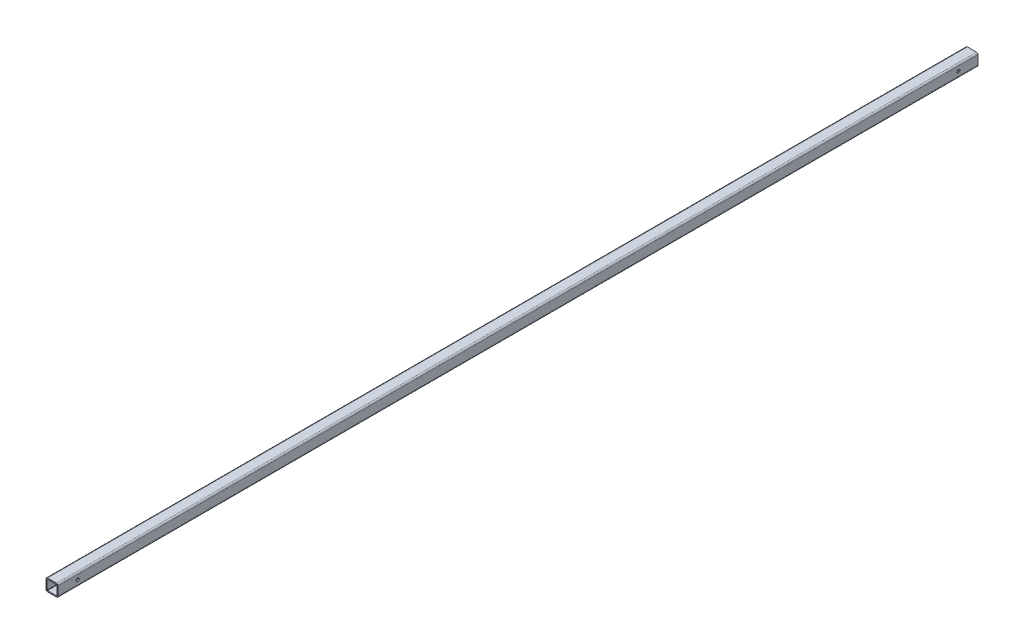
ISO-10303-21;
HEADER;
FILE_DESCRIPTION(('STEP AP214'),'2;1');
FILE_NAME('part.step','',(''),(''),'','','');
FILE_SCHEMA(('AUTOMOTIVE_DESIGN { 1 0 10303 214 1 1 1 1 }'));
ENDSEC;
DATA;
#1=APPLICATION_CONTEXT('core data for automotive mechanical design processes');
#2=APPLICATION_PROTOCOL_DEFINITION('international standard','automotive_design',2000,#1);
#3=PRODUCT_CONTEXT('',#1,'mechanical');
#4=PRODUCT('Part','Part','',(#3));
#5=PRODUCT_RELATED_PRODUCT_CATEGORY('part','',(#4));
#6=PRODUCT_DEFINITION_FORMATION('','',#4);
#7=PRODUCT_DEFINITION_CONTEXT('part definition',#1,'design');
#8=PRODUCT_DEFINITION('design','',#6,#7);
#9=PRODUCT_DEFINITION_SHAPE('','',#8);
#10=(LENGTH_UNIT() NAMED_UNIT(*) SI_UNIT(.MILLI.,.METRE.));
#11=(NAMED_UNIT(*) PLANE_ANGLE_UNIT() SI_UNIT($,.RADIAN.));
#12=(NAMED_UNIT(*) SI_UNIT($,.STERADIAN.) SOLID_ANGLE_UNIT());
#13=UNCERTAINTY_MEASURE_WITH_UNIT(LENGTH_MEASURE(1.E-05),#10,'distance_accuracy_value','');
#14=(GEOMETRIC_REPRESENTATION_CONTEXT(3) GLOBAL_UNCERTAINTY_ASSIGNED_CONTEXT((#13)) GLOBAL_UNIT_ASSIGNED_CONTEXT((#10,
#11,#12)) REPRESENTATION_CONTEXT('',''));
#15=CARTESIAN_POINT('',(0.,0.,0.));
#16=DIRECTION('',(0.,0.,1.));
#17=DIRECTION('',(1.,0.,0.));
#18=AXIS2_PLACEMENT_3D('',#15,#16,#17);
#19=CARTESIAN_POINT('',(6.,-6.,1220.));
#20=DIRECTION('',(0.,0.,1.));
#21=DIRECTION('',(1.,0.,0.));
#22=AXIS2_PLACEMENT_3D('',#19,#20,#21);
#23=PLANE('',#22);
#24=CARTESIAN_POINT('',(6.,-6.,1220.));
#25=DIRECTION('',(0.,0.,1.));
#26=DIRECTION('',(1.,0.,0.));
#27=AXIS2_PLACEMENT_3D('',#24,#25,#26);
#28=CIRCLE('',#27,2.);
#29=CARTESIAN_POINT('',(5.99999999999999,-8.,1220.));
#30=VERTEX_POINT('',#29);
#31=CARTESIAN_POINT('',(8.,-5.99999999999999,1220.));
#32=VERTEX_POINT('',#31);
#33=EDGE_CURVE('E215',#30,#32,#28,.T.);
#34=ORIENTED_EDGE('',*,*,#33,.T.);
#35=DIRECTION('',(0.,1.,0.));
#36=VECTOR('',#35,1.);
#37=CARTESIAN_POINT('',(8.,5.99999999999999,1220.));
#38=LINE('',#37,#36);
#39=CARTESIAN_POINT('',(8.,5.99999999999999,1220.));
#40=VERTEX_POINT('',#39);
#41=EDGE_CURVE('E218',#32,#40,#38,.T.);
#42=ORIENTED_EDGE('',*,*,#41,.T.);
#43=CARTESIAN_POINT('',(6.,6.,1220.));
#44=DIRECTION('',(0.,0.,1.));
#45=DIRECTION('',(-1.,0.,0.));
#46=AXIS2_PLACEMENT_3D('',#43,#44,#45);
#47=CIRCLE('',#46,2.);
#48=CARTESIAN_POINT('',(5.99999999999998,8.,1220.));
#49=VERTEX_POINT('',#48);
#50=EDGE_CURVE('E221',#40,#49,#47,.T.);
#51=ORIENTED_EDGE('',*,*,#50,.T.);
#52=DIRECTION('',(-1.,0.,0.));
#53=VECTOR('',#52,1.);
#54=CARTESIAN_POINT('',(-5.99999999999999,8.,1220.));
#55=LINE('',#54,#53);
#56=CARTESIAN_POINT('',(-5.99999999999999,8.,1220.));
#57=VERTEX_POINT('',#56);
#58=EDGE_CURVE('E223',#49,#57,#55,.T.);
#59=ORIENTED_EDGE('',*,*,#58,.T.);
#60=CARTESIAN_POINT('',(-6.,6.,1220.));
#61=DIRECTION('',(0.,0.,1.));
#62=DIRECTION('',(1.,0.,0.));
#63=AXIS2_PLACEMENT_3D('',#60,#61,#62);
#64=CIRCLE('',#63,2.);
#65=CARTESIAN_POINT('',(-8.,5.99999999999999,1220.));
#66=VERTEX_POINT('',#65);
#67=EDGE_CURVE('E225',#57,#66,#64,.T.);
#68=ORIENTED_EDGE('',*,*,#67,.T.);
#69=DIRECTION('',(0.,-1.,0.));
#70=VECTOR('',#69,1.);
#71=CARTESIAN_POINT('',(-8.,5.99999999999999,1220.));
#72=LINE('',#71,#70);
#73=CARTESIAN_POINT('',(-8.,-5.99999999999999,1220.));
#74=VERTEX_POINT('',#73);
#75=EDGE_CURVE('E227',#66,#74,#72,.T.);
#76=ORIENTED_EDGE('',*,*,#75,.T.);
#77=CARTESIAN_POINT('',(-6.,-6.,1220.));
#78=DIRECTION('',(0.,0.,1.));
#79=DIRECTION('',(1.,0.,0.));
#80=AXIS2_PLACEMENT_3D('',#77,#78,#79);
#81=CIRCLE('',#80,2.);
#82=CARTESIAN_POINT('',(-5.99999999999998,-8.,1220.));
#83=VERTEX_POINT('',#82);
#84=EDGE_CURVE('E229',#74,#83,#81,.T.);
#85=ORIENTED_EDGE('',*,*,#84,.T.);
#86=DIRECTION('',(1.,0.,0.));
#87=VECTOR('',#86,1.);
#88=CARTESIAN_POINT('',(-5.99999999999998,-8.,1220.));
#89=LINE('',#88,#87);
#90=EDGE_CURVE('E231',#83,#30,#89,.T.);
#91=ORIENTED_EDGE('',*,*,#90,.T.);
#92=EDGE_LOOP('',(#34,#42,#51,#59,#68,#76,#85,#91));
#93=FACE_BOUND('',#92,.T.);
#94=DIRECTION('',(0.,-1.,0.));
#95=VECTOR('',#94,1.);
#96=CARTESIAN_POINT('',(-6.5,5.99999999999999,1220.));
#97=LINE('',#96,#95);
#98=CARTESIAN_POINT('',(-6.5,5.99999999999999,1220.));
#99=VERTEX_POINT('',#98);
#100=CARTESIAN_POINT('',(-6.5,-5.99999999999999,1220.));
#101=VERTEX_POINT('',#100);
#102=EDGE_CURVE('E156',#99,#101,#97,.T.);
#103=ORIENTED_EDGE('',*,*,#102,.F.);
#104=CARTESIAN_POINT('',(-6.,6.,1220.));
#105=DIRECTION('',(0.,0.,1.));
#106=DIRECTION('',(1.,0.,0.));
#107=AXIS2_PLACEMENT_3D('',#104,#105,#106);
#108=CIRCLE('',#107,0.5);
#109=CARTESIAN_POINT('',(-5.99999999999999,6.5,1220.));
#110=VERTEX_POINT('',#109);
#111=EDGE_CURVE('E148',#110,#99,#108,.T.);
#112=ORIENTED_EDGE('',*,*,#111,.F.);
#113=DIRECTION('',(-1.,0.,0.));
#114=VECTOR('',#113,1.);
#115=CARTESIAN_POINT('',(-5.99999999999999,6.5,1220.));
#116=LINE('',#115,#114);
#117=CARTESIAN_POINT('',(5.99999999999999,6.5,1220.));
#118=VERTEX_POINT('',#117);
#119=EDGE_CURVE('E182',#118,#110,#116,.T.);
#120=ORIENTED_EDGE('',*,*,#119,.F.);
#121=CARTESIAN_POINT('',(6.,6.,1220.));
#122=DIRECTION('',(0.,0.,1.));
#123=DIRECTION('',(-1.,0.,0.));
#124=AXIS2_PLACEMENT_3D('',#121,#122,#123);
#125=CIRCLE('',#124,0.5);
#126=CARTESIAN_POINT('',(6.5,5.99999999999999,1220.));
#127=VERTEX_POINT('',#126);
#128=EDGE_CURVE('E180',#127,#118,#125,.T.);
#129=ORIENTED_EDGE('',*,*,#128,.F.);
#130=DIRECTION('',(0.,1.,0.));
#131=VECTOR('',#130,1.);
#132=CARTESIAN_POINT('',(6.5,5.99999999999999,1220.));
#133=LINE('',#132,#131);
#134=CARTESIAN_POINT('',(6.5,-6.,1220.));
#135=VERTEX_POINT('',#134);
#136=EDGE_CURVE('E178',#135,#127,#133,.T.);
#137=ORIENTED_EDGE('',*,*,#136,.F.);
#138=CARTESIAN_POINT('',(6.,-6.,1220.));
#139=DIRECTION('',(0.,0.,1.));
#140=DIRECTION('',(1.,0.,0.));
#141=AXIS2_PLACEMENT_3D('',#138,#139,#140);
#142=CIRCLE('',#141,0.5);
#143=CARTESIAN_POINT('',(5.99999999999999,-6.5,1220.));
#144=VERTEX_POINT('',#143);
#145=EDGE_CURVE('E176',#144,#135,#142,.T.);
#146=ORIENTED_EDGE('',*,*,#145,.F.);
#147=DIRECTION('',(1.,0.,0.));
#148=VECTOR('',#147,1.);
#149=CARTESIAN_POINT('',(-5.99999999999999,-6.5,1220.));
#150=LINE('',#149,#148);
#151=CARTESIAN_POINT('',(-5.99999999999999,-6.5,1220.));
#152=VERTEX_POINT('',#151);
#153=EDGE_CURVE('E171',#152,#144,#150,.T.);
#154=ORIENTED_EDGE('',*,*,#153,.F.);
#155=CARTESIAN_POINT('',(-6.,-6.,1220.));
#156=DIRECTION('',(0.,0.,1.));
#157=DIRECTION('',(1.,0.,0.));
#158=AXIS2_PLACEMENT_3D('',#155,#156,#157);
#159=CIRCLE('',#158,0.500000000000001);
#160=EDGE_CURVE('E169',#101,#152,#159,.T.);
#161=ORIENTED_EDGE('',*,*,#160,.F.);
#162=EDGE_LOOP('',(#103,#112,#120,#129,#137,#146,#154,#161));
#163=FACE_BOUND('',#162,.T.);
#164=ADVANCED_FACE('F33',(#93,#163),#23,.T.);
#165=CARTESIAN_POINT('',(6.,-6.,0.));
#166=DIRECTION('',(0.,0.,1.));
#167=DIRECTION('',(1.,0.,0.));
#168=AXIS2_PLACEMENT_3D('',#165,#166,#167);
#169=PLANE('',#168);
#170=CARTESIAN_POINT('',(6.,-6.,0.));
#171=DIRECTION('',(0.,0.,1.));
#172=DIRECTION('',(1.,0.,0.));
#173=AXIS2_PLACEMENT_3D('',#170,#171,#172);
#174=CIRCLE('',#173,2.);
#175=CARTESIAN_POINT('',(5.99999999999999,-8.,0.));
#176=VERTEX_POINT('',#175);
#177=CARTESIAN_POINT('',(8.,-5.99999999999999,0.));
#178=VERTEX_POINT('',#177);
#179=EDGE_CURVE('E164',#176,#178,#174,.T.);
#180=ORIENTED_EDGE('',*,*,#179,.F.);
#181=DIRECTION('',(1.,0.,0.));
#182=VECTOR('',#181,1.);
#183=CARTESIAN_POINT('',(-5.99999999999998,-8.,0.));
#184=LINE('',#183,#182);
#185=CARTESIAN_POINT('',(-5.99999999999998,-8.,0.));
#186=VERTEX_POINT('',#185);
#187=EDGE_CURVE('E219',#186,#176,#184,.T.);
#188=ORIENTED_EDGE('',*,*,#187,.F.);
#189=CARTESIAN_POINT('',(-6.,-6.,0.));
#190=DIRECTION('',(0.,0.,1.));
#191=DIRECTION('',(1.,0.,0.));
#192=AXIS2_PLACEMENT_3D('',#189,#190,#191);
#193=CIRCLE('',#192,2.);
#194=CARTESIAN_POINT('',(-8.,-5.99999999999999,0.));
#195=VERTEX_POINT('',#194);
#196=EDGE_CURVE('E246',#195,#186,#193,.T.);
#197=ORIENTED_EDGE('',*,*,#196,.F.);
#198=DIRECTION('',(0.,-1.,0.));
#199=VECTOR('',#198,1.);
#200=CARTESIAN_POINT('',(-8.,5.99999999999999,0.));
#201=LINE('',#200,#199);
#202=CARTESIAN_POINT('',(-8.,5.99999999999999,0.));
#203=VERTEX_POINT('',#202);
#204=EDGE_CURVE('E244',#203,#195,#201,.T.);
#205=ORIENTED_EDGE('',*,*,#204,.F.);
#206=CARTESIAN_POINT('',(-6.,6.,0.));
#207=DIRECTION('',(0.,0.,1.));
#208=DIRECTION('',(1.,0.,0.));
#209=AXIS2_PLACEMENT_3D('',#206,#207,#208);
#210=CIRCLE('',#209,2.);
#211=CARTESIAN_POINT('',(-5.99999999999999,8.,0.));
#212=VERTEX_POINT('',#211);
#213=EDGE_CURVE('E242',#212,#203,#210,.T.);
#214=ORIENTED_EDGE('',*,*,#213,.F.);
#215=DIRECTION('',(-1.,0.,0.));
#216=VECTOR('',#215,1.);
#217=CARTESIAN_POINT('',(-5.99999999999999,8.,0.));
#218=LINE('',#217,#216);
#219=CARTESIAN_POINT('',(5.99999999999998,8.,0.));
#220=VERTEX_POINT('',#219);
#221=EDGE_CURVE('E240',#220,#212,#218,.T.);
#222=ORIENTED_EDGE('',*,*,#221,.F.);
#223=CARTESIAN_POINT('',(6.,6.,0.));
#224=DIRECTION('',(0.,0.,1.));
#225=DIRECTION('',(-1.,0.,0.));
#226=AXIS2_PLACEMENT_3D('',#223,#224,#225);
#227=CIRCLE('',#226,2.);
#228=CARTESIAN_POINT('',(8.,5.99999999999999,0.));
#229=VERTEX_POINT('',#228);
#230=EDGE_CURVE('E238',#229,#220,#227,.T.);
#231=ORIENTED_EDGE('',*,*,#230,.F.);
#232=DIRECTION('',(0.,1.,0.));
#233=VECTOR('',#232,1.);
#234=CARTESIAN_POINT('',(8.,5.99999999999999,0.));
#235=LINE('',#234,#233);
#236=EDGE_CURVE('E236',#178,#229,#235,.T.);
#237=ORIENTED_EDGE('',*,*,#236,.F.);
#238=EDGE_LOOP('',(#180,#188,#197,#205,#214,#222,#231,#237));
#239=FACE_BOUND('',#238,.T.);
#240=CARTESIAN_POINT('',(-6.,6.,0.));
#241=DIRECTION('',(0.,0.,1.));
#242=DIRECTION('',(1.,0.,0.));
#243=AXIS2_PLACEMENT_3D('',#240,#241,#242);
#244=CIRCLE('',#243,0.5);
#245=CARTESIAN_POINT('',(-5.99999999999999,6.5,0.));
#246=VERTEX_POINT('',#245);
#247=CARTESIAN_POINT('',(-6.5,5.99999999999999,0.));
#248=VERTEX_POINT('',#247);
#249=EDGE_CURVE('E58',#246,#248,#244,.T.);
#250=ORIENTED_EDGE('',*,*,#249,.T.);
#251=DIRECTION('',(0.,-1.,0.));
#252=VECTOR('',#251,1.);
#253=CARTESIAN_POINT('',(-6.5,5.99999999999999,0.));
#254=LINE('',#253,#252);
#255=CARTESIAN_POINT('',(-6.5,-5.99999999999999,0.));
#256=VERTEX_POINT('',#255);
#257=EDGE_CURVE('E163',#248,#256,#254,.T.);
#258=ORIENTED_EDGE('',*,*,#257,.T.);
#259=CARTESIAN_POINT('',(-6.,-6.,0.));
#260=DIRECTION('',(0.,0.,1.));
#261=DIRECTION('',(1.,0.,0.));
#262=AXIS2_PLACEMENT_3D('',#259,#260,#261);
#263=CIRCLE('',#262,0.500000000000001);
#264=CARTESIAN_POINT('',(-5.99999999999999,-6.5,0.));
#265=VERTEX_POINT('',#264);
#266=EDGE_CURVE('E187',#256,#265,#263,.T.);
#267=ORIENTED_EDGE('',*,*,#266,.T.);
#268=DIRECTION('',(1.,0.,0.));
#269=VECTOR('',#268,1.);
#270=CARTESIAN_POINT('',(-5.99999999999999,-6.5,0.));
#271=LINE('',#270,#269);
#272=CARTESIAN_POINT('',(5.99999999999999,-6.5,0.));
#273=VERTEX_POINT('',#272);
#274=EDGE_CURVE('E190',#265,#273,#271,.T.);
#275=ORIENTED_EDGE('',*,*,#274,.T.);
#276=CARTESIAN_POINT('',(6.,-6.,0.));
#277=DIRECTION('',(0.,0.,1.));
#278=DIRECTION('',(1.,0.,0.));
#279=AXIS2_PLACEMENT_3D('',#276,#277,#278);
#280=CIRCLE('',#279,0.5);
#281=CARTESIAN_POINT('',(6.5,-6.,0.));
#282=VERTEX_POINT('',#281);
#283=EDGE_CURVE('E193',#273,#282,#280,.T.);
#284=ORIENTED_EDGE('',*,*,#283,.T.);
#285=DIRECTION('',(0.,1.,0.));
#286=VECTOR('',#285,1.);
#287=CARTESIAN_POINT('',(6.5,5.99999999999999,0.));
#288=LINE('',#287,#286);
#289=CARTESIAN_POINT('',(6.5,5.99999999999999,0.));
#290=VERTEX_POINT('',#289);
#291=EDGE_CURVE('E196',#282,#290,#288,.T.);
#292=ORIENTED_EDGE('',*,*,#291,.T.);
#293=CARTESIAN_POINT('',(6.,6.,0.));
#294=DIRECTION('',(0.,0.,1.));
#295=DIRECTION('',(-1.,0.,0.));
#296=AXIS2_PLACEMENT_3D('',#293,#294,#295);
#297=CIRCLE('',#296,0.5);
#298=CARTESIAN_POINT('',(5.99999999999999,6.5,0.));
#299=VERTEX_POINT('',#298);
#300=EDGE_CURVE('E199',#290,#299,#297,.T.);
#301=ORIENTED_EDGE('',*,*,#300,.T.);
#302=DIRECTION('',(-1.,0.,0.));
#303=VECTOR('',#302,1.);
#304=CARTESIAN_POINT('',(-5.99999999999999,6.5,0.));
#305=LINE('',#304,#303);
#306=EDGE_CURVE('E157',#299,#246,#305,.T.);
#307=ORIENTED_EDGE('',*,*,#306,.T.);
#308=EDGE_LOOP('',(#250,#258,#267,#275,#284,#292,#301,#307));
#309=FACE_BOUND('',#308,.T.);
#310=ADVANCED_FACE('F311',(#239,#309),#169,.F.);
#311=CARTESIAN_POINT('',(6.,-6.,1220.));
#312=DIRECTION('',(0.,0.,-1.));
#313=DIRECTION('',(-1.,0.,0.));
#314=AXIS2_PLACEMENT_3D('',#311,#312,#313);
#315=CYLINDRICAL_SURFACE('',#314,2.);
#316=ORIENTED_EDGE('',*,*,#179,.T.);
#317=DIRECTION('',(0.,0.,-1.));
#318=VECTOR('',#317,1.);
#319=CARTESIAN_POINT('',(8.,-5.99999999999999,1220.));
#320=LINE('',#319,#318);
#321=EDGE_CURVE('E11',#32,#178,#320,.T.);
#322=ORIENTED_EDGE('',*,*,#321,.F.);
#323=ORIENTED_EDGE('',*,*,#33,.F.);
#324=DIRECTION('',(0.,0.,-1.));
#325=VECTOR('',#324,1.);
#326=CARTESIAN_POINT('',(5.99999999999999,-8.,1220.));
#327=LINE('',#326,#325);
#328=EDGE_CURVE('E233',#30,#176,#327,.T.);
#329=ORIENTED_EDGE('',*,*,#328,.T.);
#330=EDGE_LOOP('',(#316,#322,#323,#329));
#331=FACE_BOUND('',#330,.T.);
#332=ADVANCED_FACE('F35',(#331),#315,.T.);
#333=CARTESIAN_POINT('',(8.,5.99999999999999,1220.));
#334=DIRECTION('',(-1.,0.,0.));
#335=DIRECTION('',(0.,-1.,0.));
#336=AXIS2_PLACEMENT_3D('',#333,#334,#335);
#337=PLANE('',#336);
#338=CARTESIAN_POINT('',(8.,0.,26.));
#339=DIRECTION('',(1.,0.,0.));
#340=DIRECTION('',(0.,1.,0.));
#341=AXIS2_PLACEMENT_3D('',#338,#339,#340);
#342=CIRCLE('',#341,2.);
#343=CARTESIAN_POINT('',(8.,2.00000000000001,26.));
#344=VERTEX_POINT('',#343);
#345=EDGE_CURVE('E284',#344,#344,#342,.T.);
#346=ORIENTED_EDGE('',*,*,#345,.F.);
#347=EDGE_LOOP('',(#346));
#348=FACE_BOUND('',#347,.T.);
#349=CARTESIAN_POINT('',(8.,0.,1194.));
#350=DIRECTION('',(1.,0.,0.));
#351=DIRECTION('',(0.,1.,0.));
#352=AXIS2_PLACEMENT_3D('',#349,#350,#351);
#353=CIRCLE('',#352,2.0000000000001);
#354=CARTESIAN_POINT('',(8.,2.0000000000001,1194.));
#355=VERTEX_POINT('',#354);
#356=EDGE_CURVE('E274',#355,#355,#353,.T.);
#357=ORIENTED_EDGE('',*,*,#356,.F.);
#358=EDGE_LOOP('',(#357));
#359=FACE_BOUND('',#358,.T.);
#360=ORIENTED_EDGE('',*,*,#236,.T.);
#361=DIRECTION('',(0.,0.,-1.));
#362=VECTOR('',#361,1.);
#363=CARTESIAN_POINT('',(8.,5.99999999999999,1220.));
#364=LINE('',#363,#362);
#365=EDGE_CURVE('E42',#40,#229,#364,.T.);
#366=ORIENTED_EDGE('',*,*,#365,.F.);
#367=ORIENTED_EDGE('',*,*,#41,.F.);
#368=ORIENTED_EDGE('',*,*,#321,.T.);
#369=EDGE_LOOP('',(#360,#366,#367,#368));
#370=FACE_BOUND('',#369,.T.);
#371=ADVANCED_FACE('F361',(#348,#359,#370),#337,.F.);
#372=CARTESIAN_POINT('',(6.,6.,1220.));
#373=DIRECTION('',(0.,0.,-1.));
#374=DIRECTION('',(-1.,0.,0.));
#375=AXIS2_PLACEMENT_3D('',#372,#373,#374);
#376=CYLINDRICAL_SURFACE('',#375,2.);
#377=ORIENTED_EDGE('',*,*,#230,.T.);
#378=DIRECTION('',(0.,0.,-1.));
#379=VECTOR('',#378,1.);
#380=CARTESIAN_POINT('',(5.99999999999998,8.,1220.));
#381=LINE('',#380,#379);
#382=EDGE_CURVE('E263',#49,#220,#381,.T.);
#383=ORIENTED_EDGE('',*,*,#382,.F.);
#384=ORIENTED_EDGE('',*,*,#50,.F.);
#385=ORIENTED_EDGE('',*,*,#365,.T.);
#386=EDGE_LOOP('',(#377,#383,#384,#385));
#387=FACE_BOUND('',#386,.T.);
#388=ADVANCED_FACE('F358',(#387),#376,.T.);
#389=CARTESIAN_POINT('',(-5.99999999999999,8.,1220.));
#390=DIRECTION('',(0.,-1.,0.));
#391=DIRECTION('',(0.,0.,-1.));
#392=AXIS2_PLACEMENT_3D('',#389,#390,#391);
#393=PLANE('',#392);
#394=ORIENTED_EDGE('',*,*,#221,.T.);
#395=DIRECTION('',(0.,0.,-1.));
#396=VECTOR('',#395,1.);
#397=CARTESIAN_POINT('',(-5.99999999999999,8.,1220.));
#398=LINE('',#397,#396);
#399=EDGE_CURVE('E260',#57,#212,#398,.T.);
#400=ORIENTED_EDGE('',*,*,#399,.F.);
#401=ORIENTED_EDGE('',*,*,#58,.F.);
#402=ORIENTED_EDGE('',*,*,#382,.T.);
#403=EDGE_LOOP('',(#394,#400,#401,#402));
#404=FACE_BOUND('',#403,.T.);
#405=ADVANCED_FACE('F354',(#404),#393,.F.);
#406=CARTESIAN_POINT('',(-6.,6.,1220.));
#407=DIRECTION('',(0.,0.,-1.));
#408=DIRECTION('',(-1.,0.,0.));
#409=AXIS2_PLACEMENT_3D('',#406,#407,#408);
#410=CYLINDRICAL_SURFACE('',#409,2.);
#411=ORIENTED_EDGE('',*,*,#213,.T.);
#412=DIRECTION('',(0.,0.,-1.));
#413=VECTOR('',#412,1.);
#414=CARTESIAN_POINT('',(-8.,5.99999999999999,1220.));
#415=LINE('',#414,#413);
#416=EDGE_CURVE('E257',#66,#203,#415,.T.);
#417=ORIENTED_EDGE('',*,*,#416,.F.);
#418=ORIENTED_EDGE('',*,*,#67,.F.);
#419=ORIENTED_EDGE('',*,*,#399,.T.);
#420=EDGE_LOOP('',(#411,#417,#418,#419));
#421=FACE_BOUND('',#420,.T.);
#422=ADVANCED_FACE('F351',(#421),#410,.T.);
#423=CARTESIAN_POINT('',(-8.,5.99999999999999,1220.));
#424=DIRECTION('',(1.,0.,0.));
#425=DIRECTION('',(0.,1.,0.));
#426=AXIS2_PLACEMENT_3D('',#423,#424,#425);
#427=PLANE('',#426);
#428=CARTESIAN_POINT('',(-8.,0.,26.));
#429=DIRECTION('',(1.,0.,0.));
#430=DIRECTION('',(0.,1.,0.));
#431=AXIS2_PLACEMENT_3D('',#428,#429,#430);
#432=CIRCLE('',#431,2.);
#433=CARTESIAN_POINT('',(-8.,2.,26.));
#434=VERTEX_POINT('',#433);
#435=EDGE_CURVE('E287',#434,#434,#432,.T.);
#436=ORIENTED_EDGE('',*,*,#435,.T.);
#437=EDGE_LOOP('',(#436));
#438=FACE_BOUND('',#437,.T.);
#439=CARTESIAN_POINT('',(-8.,0.,1194.));
#440=DIRECTION('',(1.,0.,0.));
#441=DIRECTION('',(0.,1.,0.));
#442=AXIS2_PLACEMENT_3D('',#439,#440,#441);
#443=CIRCLE('',#442,2.0000000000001);
#444=CARTESIAN_POINT('',(-8.,2.0000000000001,1194.));
#445=VERTEX_POINT('',#444);
#446=EDGE_CURVE('E269',#445,#445,#443,.T.);
#447=ORIENTED_EDGE('',*,*,#446,.T.);
#448=EDGE_LOOP('',(#447));
#449=FACE_BOUND('',#448,.T.);
#450=ORIENTED_EDGE('',*,*,#204,.T.);
#451=DIRECTION('',(0.,0.,-1.));
#452=VECTOR('',#451,1.);
#453=CARTESIAN_POINT('',(-8.,-5.99999999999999,1220.));
#454=LINE('',#453,#452);
#455=EDGE_CURVE('E254',#74,#195,#454,.T.);
#456=ORIENTED_EDGE('',*,*,#455,.F.);
#457=ORIENTED_EDGE('',*,*,#75,.F.);
#458=ORIENTED_EDGE('',*,*,#416,.T.);
#459=EDGE_LOOP('',(#450,#456,#457,#458));
#460=FACE_BOUND('',#459,.T.);
#461=ADVANCED_FACE('F347',(#438,#449,#460),#427,.F.);
#462=CARTESIAN_POINT('',(-6.,-6.,1220.));
#463=DIRECTION('',(0.,0.,-1.));
#464=DIRECTION('',(-1.,0.,0.));
#465=AXIS2_PLACEMENT_3D('',#462,#463,#464);
#466=CYLINDRICAL_SURFACE('',#465,2.);
#467=ORIENTED_EDGE('',*,*,#196,.T.);
#468=DIRECTION('',(0.,0.,-1.));
#469=VECTOR('',#468,1.);
#470=CARTESIAN_POINT('',(-5.99999999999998,-8.,1220.));
#471=LINE('',#470,#469);
#472=EDGE_CURVE('E251',#83,#186,#471,.T.);
#473=ORIENTED_EDGE('',*,*,#472,.F.);
#474=ORIENTED_EDGE('',*,*,#84,.F.);
#475=ORIENTED_EDGE('',*,*,#455,.T.);
#476=EDGE_LOOP('',(#467,#473,#474,#475));
#477=FACE_BOUND('',#476,.T.);
#478=ADVANCED_FACE('F343',(#477),#466,.T.);
#479=CARTESIAN_POINT('',(-5.99999999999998,-8.,1220.));
#480=DIRECTION('',(0.,1.,0.));
#481=DIRECTION('',(0.,0.,1.));
#482=AXIS2_PLACEMENT_3D('',#479,#480,#481);
#483=PLANE('',#482);
#484=ORIENTED_EDGE('',*,*,#187,.T.);
#485=ORIENTED_EDGE('',*,*,#328,.F.);
#486=ORIENTED_EDGE('',*,*,#90,.F.);
#487=ORIENTED_EDGE('',*,*,#472,.T.);
#488=EDGE_LOOP('',(#484,#485,#486,#487));
#489=FACE_BOUND('',#488,.T.);
#490=ADVANCED_FACE('F340',(#489),#483,.F.);
#491=CARTESIAN_POINT('',(-6.,6.,1220.));
#492=DIRECTION('',(0.,0.,-1.));
#493=DIRECTION('',(-1.,0.,0.));
#494=AXIS2_PLACEMENT_3D('',#491,#492,#493);
#495=CYLINDRICAL_SURFACE('',#494,0.5);
#496=ORIENTED_EDGE('',*,*,#249,.F.);
#497=DIRECTION('',(0.,0.,-1.));
#498=VECTOR('',#497,1.);
#499=CARTESIAN_POINT('',(-5.99999999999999,6.5,1220.));
#500=LINE('',#499,#498);
#501=EDGE_CURVE('E152',#110,#246,#500,.T.);
#502=ORIENTED_EDGE('',*,*,#501,.F.);
#503=ORIENTED_EDGE('',*,*,#111,.T.);
#504=DIRECTION('',(0.,0.,-1.));
#505=VECTOR('',#504,1.);
#506=CARTESIAN_POINT('',(-6.5,5.99999999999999,1220.));
#507=LINE('',#506,#505);
#508=EDGE_CURVE('E151',#99,#248,#507,.T.);
#509=ORIENTED_EDGE('',*,*,#508,.T.);
#510=EDGE_LOOP('',(#496,#502,#503,#509));
#511=FACE_BOUND('',#510,.T.);
#512=ADVANCED_FACE('F150',(#511),#495,.F.);
#513=CARTESIAN_POINT('',(-6.5,5.99999999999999,1220.));
#514=DIRECTION('',(1.,0.,0.));
#515=DIRECTION('',(0.,0.,-1.));
#516=AXIS2_PLACEMENT_3D('',#513,#514,#515);
#517=PLANE('',#516);
#518=CARTESIAN_POINT('',(-6.5,0.,26.));
#519=DIRECTION('',(1.,0.,0.));
#520=DIRECTION('',(0.,0.,-1.));
#521=AXIS2_PLACEMENT_3D('',#518,#519,#520);
#522=CIRCLE('',#521,2.);
#523=CARTESIAN_POINT('',(-6.5,0.,24.));
#524=VERTEX_POINT('',#523);
#525=EDGE_CURVE('E279',#524,#524,#522,.T.);
#526=ORIENTED_EDGE('',*,*,#525,.F.);
#527=EDGE_LOOP('',(#526));
#528=FACE_BOUND('',#527,.T.);
#529=CARTESIAN_POINT('',(-6.5,0.,1194.));
#530=DIRECTION('',(1.,0.,0.));
#531=DIRECTION('',(0.,0.,-1.));
#532=AXIS2_PLACEMENT_3D('',#529,#530,#531);
#533=CIRCLE('',#532,2.0000000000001);
#534=CARTESIAN_POINT('',(-6.5,0.,1192.));
#535=VERTEX_POINT('',#534);
#536=EDGE_CURVE('E185',#535,#535,#533,.T.);
#537=ORIENTED_EDGE('',*,*,#536,.F.);
#538=EDGE_LOOP('',(#537));
#539=FACE_BOUND('',#538,.T.);
#540=ORIENTED_EDGE('',*,*,#257,.F.);
#541=ORIENTED_EDGE('',*,*,#508,.F.);
#542=ORIENTED_EDGE('',*,*,#102,.T.);
#543=DIRECTION('',(0.,0.,-1.));
#544=VECTOR('',#543,1.);
#545=CARTESIAN_POINT('',(-6.5,-5.99999999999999,1220.));
#546=LINE('',#545,#544);
#547=EDGE_CURVE('E165',#101,#256,#546,.T.);
#548=ORIENTED_EDGE('',*,*,#547,.T.);
#549=EDGE_LOOP('',(#540,#541,#542,#548));
#550=FACE_BOUND('',#549,.T.);
#551=ADVANCED_FACE('F160',(#528,#539,#550),#517,.T.);
#552=CARTESIAN_POINT('',(-6.,-6.,1220.));
#553=DIRECTION('',(0.,0.,-1.));
#554=DIRECTION('',(-1.,0.,0.));
#555=AXIS2_PLACEMENT_3D('',#552,#553,#554);
#556=CYLINDRICAL_SURFACE('',#555,0.500000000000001);
#557=ORIENTED_EDGE('',*,*,#266,.F.);
#558=ORIENTED_EDGE('',*,*,#547,.F.);
#559=ORIENTED_EDGE('',*,*,#160,.T.);
#560=DIRECTION('',(0.,0.,-1.));
#561=VECTOR('',#560,1.);
#562=CARTESIAN_POINT('',(-5.99999999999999,-6.5,1220.));
#563=LINE('',#562,#561);
#564=EDGE_CURVE('E212',#152,#265,#563,.T.);
#565=ORIENTED_EDGE('',*,*,#564,.T.);
#566=EDGE_LOOP('',(#557,#558,#559,#565));
#567=FACE_BOUND('',#566,.T.);
#568=ADVANCED_FACE('F412',(#567),#556,.F.);
#569=CARTESIAN_POINT('',(-5.99999999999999,-6.5,1220.));
#570=DIRECTION('',(0.,1.,0.));
#571=DIRECTION('',(0.,0.,1.));
#572=AXIS2_PLACEMENT_3D('',#569,#570,#571);
#573=PLANE('',#572);
#574=ORIENTED_EDGE('',*,*,#274,.F.);
#575=ORIENTED_EDGE('',*,*,#564,.F.);
#576=ORIENTED_EDGE('',*,*,#153,.T.);
#577=DIRECTION('',(0.,0.,-1.));
#578=VECTOR('',#577,1.);
#579=CARTESIAN_POINT('',(5.99999999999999,-6.5,1220.));
#580=LINE('',#579,#578);
#581=EDGE_CURVE('E210',#144,#273,#580,.T.);
#582=ORIENTED_EDGE('',*,*,#581,.T.);
#583=EDGE_LOOP('',(#574,#575,#576,#582));
#584=FACE_BOUND('',#583,.T.);
#585=ADVANCED_FACE('F417',(#584),#573,.T.);
#586=CARTESIAN_POINT('',(6.,-6.,1220.));
#587=DIRECTION('',(0.,0.,-1.));
#588=DIRECTION('',(-1.,0.,0.));
#589=AXIS2_PLACEMENT_3D('',#586,#587,#588);
#590=CYLINDRICAL_SURFACE('',#589,0.5);
#591=ORIENTED_EDGE('',*,*,#283,.F.);
#592=ORIENTED_EDGE('',*,*,#581,.F.);
#593=ORIENTED_EDGE('',*,*,#145,.T.);
#594=DIRECTION('',(0.,0.,-1.));
#595=VECTOR('',#594,1.);
#596=CARTESIAN_POINT('',(6.5,-6.,1220.));
#597=LINE('',#596,#595);
#598=EDGE_CURVE('E208',#135,#282,#597,.T.);
#599=ORIENTED_EDGE('',*,*,#598,.T.);
#600=EDGE_LOOP('',(#591,#592,#593,#599));
#601=FACE_BOUND('',#600,.T.);
#602=ADVANCED_FACE('F301',(#601),#590,.F.);
#603=CARTESIAN_POINT('',(6.5,5.99999999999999,1220.));
#604=DIRECTION('',(-1.,0.,0.));
#605=DIRECTION('',(0.,-1.,0.));
#606=AXIS2_PLACEMENT_3D('',#603,#604,#605);
#607=PLANE('',#606);
#608=CARTESIAN_POINT('',(6.5,0.,26.));
#609=DIRECTION('',(-1.,0.,0.));
#610=DIRECTION('',(0.,-1.,0.));
#611=AXIS2_PLACEMENT_3D('',#608,#609,#610);
#612=CIRCLE('',#611,2.);
#613=CARTESIAN_POINT('',(6.5,-2.,26.));
#614=VERTEX_POINT('',#613);
#615=EDGE_CURVE('E37',#614,#614,#612,.T.);
#616=ORIENTED_EDGE('',*,*,#615,.F.);
#617=EDGE_LOOP('',(#616));
#618=FACE_BOUND('',#617,.T.);
#619=CARTESIAN_POINT('',(6.5,0.,1194.));
#620=DIRECTION('',(-1.,0.,0.));
#621=DIRECTION('',(0.,-1.,0.));
#622=AXIS2_PLACEMENT_3D('',#619,#620,#621);
#623=CIRCLE('',#622,2.0000000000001);
#624=CARTESIAN_POINT('',(6.5,-2.0000000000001,1194.));
#625=VERTEX_POINT('',#624);
#626=EDGE_CURVE('E267',#625,#625,#623,.T.);
#627=ORIENTED_EDGE('',*,*,#626,.F.);
#628=EDGE_LOOP('',(#627));
#629=FACE_BOUND('',#628,.T.);
#630=ORIENTED_EDGE('',*,*,#291,.F.);
#631=ORIENTED_EDGE('',*,*,#598,.F.);
#632=ORIENTED_EDGE('',*,*,#136,.T.);
#633=DIRECTION('',(0.,0.,-1.));
#634=VECTOR('',#633,1.);
#635=CARTESIAN_POINT('',(6.5,5.99999999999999,1220.));
#636=LINE('',#635,#634);
#637=EDGE_CURVE('E206',#127,#290,#636,.T.);
#638=ORIENTED_EDGE('',*,*,#637,.T.);
#639=EDGE_LOOP('',(#630,#631,#632,#638));
#640=FACE_BOUND('',#639,.T.);
#641=ADVANCED_FACE('F297',(#618,#629,#640),#607,.T.);
#642=CARTESIAN_POINT('',(6.,6.,1220.));
#643=DIRECTION('',(0.,0.,-1.));
#644=DIRECTION('',(-1.,0.,0.));
#645=AXIS2_PLACEMENT_3D('',#642,#643,#644);
#646=CYLINDRICAL_SURFACE('',#645,0.5);
#647=ORIENTED_EDGE('',*,*,#300,.F.);
#648=ORIENTED_EDGE('',*,*,#637,.F.);
#649=ORIENTED_EDGE('',*,*,#128,.T.);
#650=DIRECTION('',(0.,0.,-1.));
#651=VECTOR('',#650,1.);
#652=CARTESIAN_POINT('',(5.99999999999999,6.5,1220.));
#653=LINE('',#652,#651);
#654=EDGE_CURVE('E50',#118,#299,#653,.T.);
#655=ORIENTED_EDGE('',*,*,#654,.T.);
#656=EDGE_LOOP('',(#647,#648,#649,#655));
#657=FACE_BOUND('',#656,.T.);
#658=ADVANCED_FACE('F300',(#657),#646,.F.);
#659=CARTESIAN_POINT('',(-5.99999999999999,6.5,1220.));
#660=DIRECTION('',(0.,-1.,0.));
#661=DIRECTION('',(0.,0.,-1.));
#662=AXIS2_PLACEMENT_3D('',#659,#660,#661);
#663=PLANE('',#662);
#664=ORIENTED_EDGE('',*,*,#306,.F.);
#665=ORIENTED_EDGE('',*,*,#654,.F.);
#666=ORIENTED_EDGE('',*,*,#119,.T.);
#667=ORIENTED_EDGE('',*,*,#501,.T.);
#668=EDGE_LOOP('',(#664,#665,#666,#667));
#669=FACE_BOUND('',#668,.T.);
#670=ADVANCED_FACE('F318',(#669),#663,.T.);
#671=CARTESIAN_POINT('',(-8.,0.,1194.));
#672=DIRECTION('',(1.,0.,0.));
#673=DIRECTION('',(0.,1.,0.));
#674=AXIS2_PLACEMENT_3D('',#671,#672,#673);
#675=CYLINDRICAL_SURFACE('',#674,2.0000000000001);
#676=ORIENTED_EDGE('',*,*,#626,.T.);
#677=EDGE_LOOP('',(#676));
#678=FACE_BOUND('',#677,.T.);
#679=ORIENTED_EDGE('',*,*,#356,.T.);
#680=EDGE_LOOP('',(#679));
#681=FACE_BOUND('',#680,.T.);
#682=ADVANCED_FACE('F320',(#678,#681),#675,.F.);
#683=ORIENTED_EDGE('',*,*,#536,.T.);
#684=EDGE_LOOP('',(#683));
#685=FACE_BOUND('',#684,.T.);
#686=ORIENTED_EDGE('',*,*,#446,.F.);
#687=EDGE_LOOP('',(#686));
#688=FACE_BOUND('',#687,.T.);
#689=ADVANCED_FACE('F326',(#685,#688),#675,.F.);
#690=CARTESIAN_POINT('',(-8.,0.,26.));
#691=DIRECTION('',(1.,0.,0.));
#692=DIRECTION('',(0.,1.,0.));
#693=AXIS2_PLACEMENT_3D('',#690,#691,#692);
#694=CYLINDRICAL_SURFACE('',#693,2.);
#695=ORIENTED_EDGE('',*,*,#615,.T.);
#696=EDGE_LOOP('',(#695));
#697=FACE_BOUND('',#696,.T.);
#698=ORIENTED_EDGE('',*,*,#345,.T.);
#699=EDGE_LOOP('',(#698));
#700=FACE_BOUND('',#699,.T.);
#701=ADVANCED_FACE('F294',(#697,#700),#694,.F.);
#702=ORIENTED_EDGE('',*,*,#525,.T.);
#703=EDGE_LOOP('',(#702));
#704=FACE_BOUND('',#703,.T.);
#705=ORIENTED_EDGE('',*,*,#435,.F.);
#706=EDGE_LOOP('',(#705));
#707=FACE_BOUND('',#706,.T.);
#708=ADVANCED_FACE('F398',(#704,#707),#694,.F.);
#709=CLOSED_SHELL('',(#164,#310,#332,#371,#388,#405,#422,#461,#478,#490,#512,#551,#568,#585,
#602,#641,#658,#670,#682,#689,#701,#708));
#710=MANIFOLD_SOLID_BREP('B2',#709);
#711=ADVANCED_BREP_SHAPE_REPRESENTATION('',(#18,#710),#14);
#712=SHAPE_DEFINITION_REPRESENTATION(#9,#711);
ENDSEC;
END-ISO-10303-21;
